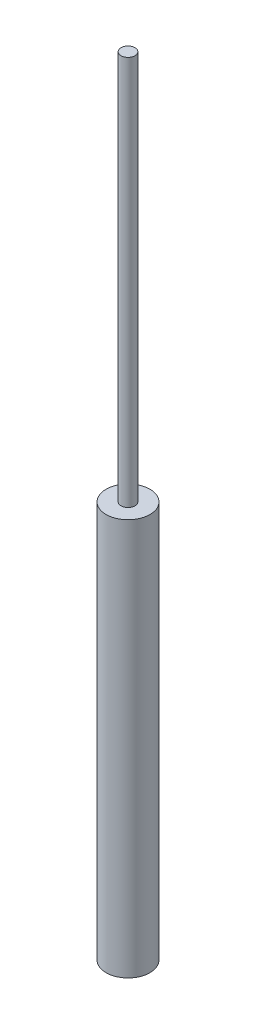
ISO-10303-21;
HEADER;
FILE_DESCRIPTION(('STEP AP214'),'2;1');
FILE_NAME('part.step','',(''),(''),'','','');
FILE_SCHEMA(('AUTOMOTIVE_DESIGN { 1 0 10303 214 1 1 1 1 }'));
ENDSEC;
DATA;
#1=APPLICATION_CONTEXT('core data for automotive mechanical design processes');
#2=APPLICATION_PROTOCOL_DEFINITION('international standard','automotive_design',2000,#1);
#3=PRODUCT_CONTEXT('',#1,'mechanical');
#4=PRODUCT('Part','Part','',(#3));
#5=PRODUCT_RELATED_PRODUCT_CATEGORY('part','',(#4));
#6=PRODUCT_DEFINITION_FORMATION('','',#4);
#7=PRODUCT_DEFINITION_CONTEXT('part definition',#1,'design');
#8=PRODUCT_DEFINITION('design','',#6,#7);
#9=PRODUCT_DEFINITION_SHAPE('','',#8);
#10=(LENGTH_UNIT() NAMED_UNIT(*) SI_UNIT(.MILLI.,.METRE.));
#11=(NAMED_UNIT(*) PLANE_ANGLE_UNIT() SI_UNIT($,.RADIAN.));
#12=(NAMED_UNIT(*) SI_UNIT($,.STERADIAN.) SOLID_ANGLE_UNIT());
#13=UNCERTAINTY_MEASURE_WITH_UNIT(LENGTH_MEASURE(1.E-05),#10,'distance_accuracy_value','');
#14=(GEOMETRIC_REPRESENTATION_CONTEXT(3) GLOBAL_UNCERTAINTY_ASSIGNED_CONTEXT((#13)) GLOBAL_UNIT_ASSIGNED_CONTEXT((#10,
#11,#12)) REPRESENTATION_CONTEXT('',''));
#15=CARTESIAN_POINT('',(0.,0.,0.));
#16=DIRECTION('',(0.,0.,1.));
#17=DIRECTION('',(1.,0.,0.));
#18=AXIS2_PLACEMENT_3D('',#15,#16,#17);
#19=CARTESIAN_POINT('',(0.,603.25,0.));
#20=DIRECTION('',(0.,-1.,0.));
#21=DIRECTION('',(0.,0.,-1.));
#22=AXIS2_PLACEMENT_3D('',#19,#20,#21);
#23=CYLINDRICAL_SURFACE('',#22,20.000000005);
#24=CARTESIAN_POINT('',(0.,615.95,0.));
#25=DIRECTION('',(0.,1.,0.));
#26=DIRECTION('',(0.,0.,1.));
#27=AXIS2_PLACEMENT_3D('',#24,#25,#26);
#28=CIRCLE('',#27,20.000000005);
#29=CARTESIAN_POINT('',(0.,615.95,20.000000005));
#30=VERTEX_POINT('',#29);
#31=EDGE_CURVE('E49',#30,#30,#28,.T.);
#32=ORIENTED_EDGE('',*,*,#31,.F.);
#33=EDGE_LOOP('',(#32));
#34=FACE_BOUND('',#33,.T.);
#35=CARTESIAN_POINT('',(0.,254.,0.));
#36=DIRECTION('',(0.,-1.,0.));
#37=DIRECTION('',(0.,0.,-1.));
#38=AXIS2_PLACEMENT_3D('',#35,#36,#37);
#39=CIRCLE('',#38,20.000000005);
#40=CARTESIAN_POINT('',(0.,254.,-20.000000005));
#41=VERTEX_POINT('',#40);
#42=EDGE_CURVE('E52',#41,#41,#39,.T.);
#43=ORIENTED_EDGE('',*,*,#42,.F.);
#44=EDGE_LOOP('',(#43));
#45=FACE_BOUND('',#44,.T.);
#46=ADVANCED_FACE('F37',(#34,#45),#23,.T.);
#47=CARTESIAN_POINT('',(0.,615.95,0.));
#48=DIRECTION('',(0.,1.,0.));
#49=DIRECTION('',(0.,0.,1.));
#50=AXIS2_PLACEMENT_3D('',#47,#48,#49);
#51=PLANE('',#50);
#52=CARTESIAN_POINT('',(0.,615.95,0.));
#53=DIRECTION('',(0.,1.,0.));
#54=DIRECTION('',(0.,0.,1.));
#55=AXIS2_PLACEMENT_3D('',#52,#53,#54);
#56=CIRCLE('',#55,6.35);
#57=CARTESIAN_POINT('',(0.,615.95,6.35));
#58=VERTEX_POINT('',#57);
#59=EDGE_CURVE('E10',#58,#58,#56,.T.);
#60=ORIENTED_EDGE('',*,*,#59,.F.);
#61=EDGE_LOOP('',(#60));
#62=FACE_BOUND('',#61,.T.);
#63=ORIENTED_EDGE('',*,*,#31,.T.);
#64=EDGE_LOOP('',(#63));
#65=FACE_BOUND('',#64,.T.);
#66=ADVANCED_FACE('F72',(#62,#65),#51,.T.);
#67=CARTESIAN_POINT('',(0.,717.55,0.));
#68=DIRECTION('',(0.,-1.,0.));
#69=DIRECTION('',(0.,0.,-1.));
#70=AXIS2_PLACEMENT_3D('',#67,#68,#69);
#71=CYLINDRICAL_SURFACE('',#70,6.35);
#72=ORIENTED_EDGE('',*,*,#59,.T.);
#73=EDGE_LOOP('',(#72));
#74=FACE_BOUND('',#73,.T.);
#75=CARTESIAN_POINT('',(0.,971.55,0.));
#76=DIRECTION('',(0.,1.,0.));
#77=DIRECTION('',(0.,0.,1.));
#78=AXIS2_PLACEMENT_3D('',#75,#76,#77);
#79=CIRCLE('',#78,6.35);
#80=CARTESIAN_POINT('',(0.,971.55,6.35));
#81=VERTEX_POINT('',#80);
#82=EDGE_CURVE('E61',#81,#81,#79,.T.);
#83=ORIENTED_EDGE('',*,*,#82,.F.);
#84=EDGE_LOOP('',(#83));
#85=FACE_BOUND('',#84,.T.);
#86=ADVANCED_FACE('F69',(#74,#85),#71,.T.);
#87=CARTESIAN_POINT('',(0.,254.,0.));
#88=DIRECTION('',(0.,-1.,0.));
#89=DIRECTION('',(0.,0.,-1.));
#90=AXIS2_PLACEMENT_3D('',#87,#88,#89);
#91=PLANE('',#90);
#92=CARTESIAN_POINT('',(1.24968,254.,0.));
#93=DIRECTION('',(0.,-1.,0.));
#94=DIRECTION('',(0.,0.,-1.));
#95=AXIS2_PLACEMENT_3D('',#92,#93,#94);
#96=CIRCLE('',#95,16.031467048);
#97=CARTESIAN_POINT('',(1.24968,254.,-16.031467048));
#98=VERTEX_POINT('',#97);
#99=EDGE_CURVE('E40',#98,#98,#96,.F.);
#100=ORIENTED_EDGE('',*,*,#99,.T.);
#101=EDGE_LOOP('',(#100));
#102=FACE_BOUND('',#101,.T.);
#103=ORIENTED_EDGE('',*,*,#42,.T.);
#104=EDGE_LOOP('',(#103));
#105=FACE_BOUND('',#104,.T.);
#106=ADVANCED_FACE('F71',(#102,#105),#91,.T.);
#107=CARTESIAN_POINT('',(0.,603.25,0.));
#108=DIRECTION('',(0.,1.,0.));
#109=DIRECTION('',(0.,0.,1.));
#110=AXIS2_PLACEMENT_3D('',#107,#108,#109);
#111=PLANE('',#110);
#112=CARTESIAN_POINT('',(1.24968,603.25,0.));
#113=DIRECTION('',(0.,1.,0.));
#114=DIRECTION('',(0.,0.,1.));
#115=AXIS2_PLACEMENT_3D('',#112,#113,#114);
#116=CIRCLE('',#115,16.031467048);
#117=CARTESIAN_POINT('',(1.24968,603.25,16.031467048));
#118=VERTEX_POINT('',#117);
#119=EDGE_CURVE('E44',#118,#118,#116,.T.);
#120=ORIENTED_EDGE('',*,*,#119,.F.);
#121=EDGE_LOOP('',(#120));
#122=FACE_BOUND('',#121,.T.);
#123=ADVANCED_FACE('F79',(#122),#111,.F.);
#124=CARTESIAN_POINT('',(1.24968,0.,0.));
#125=DIRECTION('',(0.,1.,0.));
#126=DIRECTION('',(0.,0.,1.));
#127=AXIS2_PLACEMENT_3D('',#124,#125,#126);
#128=CYLINDRICAL_SURFACE('',#127,16.031467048);
#129=ORIENTED_EDGE('',*,*,#119,.T.);
#130=EDGE_LOOP('',(#129));
#131=FACE_BOUND('',#130,.T.);
#132=ORIENTED_EDGE('',*,*,#99,.F.);
#133=EDGE_LOOP('',(#132));
#134=FACE_BOUND('',#133,.T.);
#135=ADVANCED_FACE('F100',(#131,#134),#128,.F.);
#136=CARTESIAN_POINT('',(0.,971.55,0.));
#137=DIRECTION('',(0.,1.,0.));
#138=DIRECTION('',(0.,0.,1.));
#139=AXIS2_PLACEMENT_3D('',#136,#137,#138);
#140=PLANE('',#139);
#141=ORIENTED_EDGE('',*,*,#82,.T.);
#142=EDGE_LOOP('',(#141));
#143=FACE_BOUND('',#142,.T.);
#144=ADVANCED_FACE('F67',(#143),#140,.T.);
#145=CLOSED_SHELL('',(#46,#66,#86,#106,#123,#135,#144));
#146=MANIFOLD_SOLID_BREP('B2',#145);
#147=ADVANCED_BREP_SHAPE_REPRESENTATION('',(#18,#146),#14);
#148=SHAPE_DEFINITION_REPRESENTATION(#9,#147);
ENDSEC;
END-ISO-10303-21;
